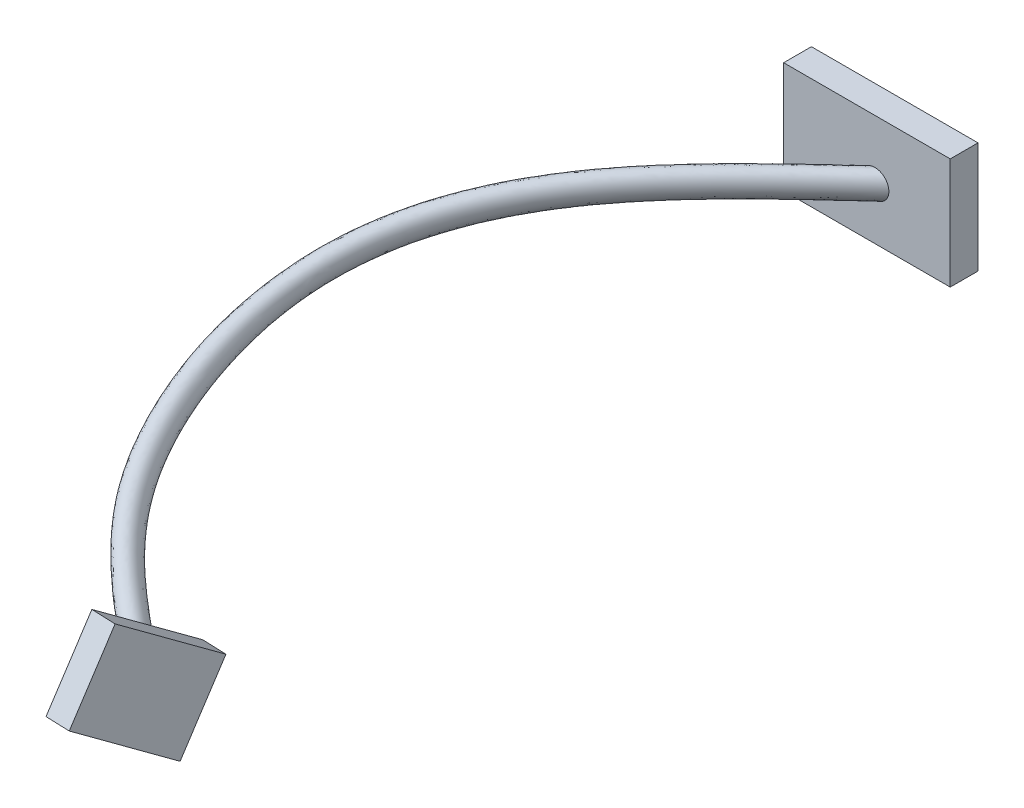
ISO-10303-21;
HEADER;
FILE_DESCRIPTION(('STEP AP214'),'2;1');
FILE_NAME('part.step','',(''),(''),'','','');
FILE_SCHEMA(('AUTOMOTIVE_DESIGN { 1 0 10303 214 1 1 1 1 }'));
ENDSEC;
DATA;
#1=APPLICATION_CONTEXT('core data for automotive mechanical design processes');
#2=APPLICATION_PROTOCOL_DEFINITION('international standard','automotive_design',2000,#1);
#3=PRODUCT_CONTEXT('',#1,'mechanical');
#4=PRODUCT('Part','Part','',(#3));
#5=PRODUCT_RELATED_PRODUCT_CATEGORY('part','',(#4));
#6=PRODUCT_DEFINITION_FORMATION('','',#4);
#7=PRODUCT_DEFINITION_CONTEXT('part definition',#1,'design');
#8=PRODUCT_DEFINITION('design','',#6,#7);
#9=PRODUCT_DEFINITION_SHAPE('','',#8);
#10=(LENGTH_UNIT() NAMED_UNIT(*) SI_UNIT(.MILLI.,.METRE.));
#11=(NAMED_UNIT(*) PLANE_ANGLE_UNIT() SI_UNIT($,.RADIAN.));
#12=(NAMED_UNIT(*) SI_UNIT($,.STERADIAN.) SOLID_ANGLE_UNIT());
#13=UNCERTAINTY_MEASURE_WITH_UNIT(LENGTH_MEASURE(1.E-05),#10,'distance_accuracy_value','');
#14=(GEOMETRIC_REPRESENTATION_CONTEXT(3) GLOBAL_UNCERTAINTY_ASSIGNED_CONTEXT((#13)) GLOBAL_UNIT_ASSIGNED_CONTEXT((#10,
#11,#12)) REPRESENTATION_CONTEXT('',''));
#15=CARTESIAN_POINT('',(0.,0.,0.));
#16=DIRECTION('',(0.,0.,1.));
#17=DIRECTION('',(1.,0.,0.));
#18=AXIS2_PLACEMENT_3D('',#15,#16,#17);
#19=CARTESIAN_POINT('',(-68.4657754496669,-154.454318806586,6.35));
#20=DIRECTION('',(-1.,0.,0.));
#21=DIRECTION('',(0.,0.,1.));
#22=AXIS2_PLACEMENT_3D('',#19,#20,#21);
#23=PLANE('',#22);
#24=DIRECTION('',(0.,1.,0.));
#25=VECTOR('',#24,1.);
#26=CARTESIAN_POINT('',(-68.4657754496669,-154.454318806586,0.));
#27=LINE('',#26,#25);
#28=CARTESIAN_POINT('',(-68.4657754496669,-154.454318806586,0.));
#29=VERTEX_POINT('',#28);
#30=CARTESIAN_POINT('',(-68.4657754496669,-129.054318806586,0.));
#31=VERTEX_POINT('',#30);
#32=EDGE_CURVE('E138',#29,#31,#27,.T.);
#33=ORIENTED_EDGE('',*,*,#32,.T.);
#34=DIRECTION('',(0.,0.,-1.));
#35=VECTOR('',#34,1.);
#36=CARTESIAN_POINT('',(-68.4657754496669,-129.054318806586,6.35));
#37=LINE('',#36,#35);
#38=CARTESIAN_POINT('',(-68.4657754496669,-129.054318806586,6.35));
#39=VERTEX_POINT('',#38);
#40=EDGE_CURVE('E35',#39,#31,#37,.T.);
#41=ORIENTED_EDGE('',*,*,#40,.F.);
#42=DIRECTION('',(0.,1.,0.));
#43=VECTOR('',#42,1.);
#44=CARTESIAN_POINT('',(-68.4657754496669,-154.454318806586,6.35));
#45=LINE('',#44,#43);
#46=CARTESIAN_POINT('',(-68.4657754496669,-154.454318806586,6.35));
#47=VERTEX_POINT('',#46);
#48=EDGE_CURVE('E147',#47,#39,#45,.T.);
#49=ORIENTED_EDGE('',*,*,#48,.F.);
#50=DIRECTION('',(0.,0.,-1.));
#51=VECTOR('',#50,1.);
#52=CARTESIAN_POINT('',(-68.4657754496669,-154.454318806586,6.35));
#53=LINE('',#52,#51);
#54=EDGE_CURVE('E154',#47,#29,#53,.T.);
#55=ORIENTED_EDGE('',*,*,#54,.T.);
#56=EDGE_LOOP('',(#33,#41,#49,#55));
#57=FACE_BOUND('',#56,.T.);
#58=ADVANCED_FACE('F28',(#57),#23,.F.);
#59=CARTESIAN_POINT('',(-68.4657754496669,-129.054318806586,6.35));
#60=DIRECTION('',(0.,-1.,0.));
#61=DIRECTION('',(0.,0.,-1.));
#62=AXIS2_PLACEMENT_3D('',#59,#60,#61);
#63=PLANE('',#62);
#64=DIRECTION('',(-1.,0.,0.));
#65=VECTOR('',#64,1.);
#66=CARTESIAN_POINT('',(-68.4657754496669,-129.054318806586,0.));
#67=LINE('',#66,#65);
#68=CARTESIAN_POINT('',(-106.565775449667,-129.054318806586,0.));
#69=VERTEX_POINT('',#68);
#70=EDGE_CURVE('E141',#31,#69,#67,.T.);
#71=ORIENTED_EDGE('',*,*,#70,.T.);
#72=DIRECTION('',(0.,0.,-1.));
#73=VECTOR('',#72,1.);
#74=CARTESIAN_POINT('',(-106.565775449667,-129.054318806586,6.35));
#75=LINE('',#74,#73);
#76=CARTESIAN_POINT('',(-106.565775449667,-129.054318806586,6.35));
#77=VERTEX_POINT('',#76);
#78=EDGE_CURVE('E160',#77,#69,#75,.T.);
#79=ORIENTED_EDGE('',*,*,#78,.F.);
#80=DIRECTION('',(-1.,0.,0.));
#81=VECTOR('',#80,1.);
#82=CARTESIAN_POINT('',(-68.4657754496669,-129.054318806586,6.35));
#83=LINE('',#82,#81);
#84=EDGE_CURVE('E149',#39,#77,#83,.T.);
#85=ORIENTED_EDGE('',*,*,#84,.F.);
#86=ORIENTED_EDGE('',*,*,#40,.T.);
#87=EDGE_LOOP('',(#71,#79,#85,#86));
#88=FACE_BOUND('',#87,.T.);
#89=ADVANCED_FACE('F165',(#88),#63,.F.);
#90=CARTESIAN_POINT('',(-106.565775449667,-154.454318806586,6.35));
#91=DIRECTION('',(1.,0.,0.));
#92=DIRECTION('',(0.,0.,-1.));
#93=AXIS2_PLACEMENT_3D('',#90,#91,#92);
#94=PLANE('',#93);
#95=DIRECTION('',(0.,-1.,0.));
#96=VECTOR('',#95,1.);
#97=CARTESIAN_POINT('',(-106.565775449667,-154.454318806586,0.));
#98=LINE('',#97,#96);
#99=CARTESIAN_POINT('',(-106.565775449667,-154.454318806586,0.));
#100=VERTEX_POINT('',#99);
#101=EDGE_CURVE('E143',#69,#100,#98,.T.);
#102=ORIENTED_EDGE('',*,*,#101,.T.);
#103=DIRECTION('',(0.,0.,-1.));
#104=VECTOR('',#103,1.);
#105=CARTESIAN_POINT('',(-106.565775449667,-154.454318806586,6.35));
#106=LINE('',#105,#104);
#107=CARTESIAN_POINT('',(-106.565775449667,-154.454318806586,6.35));
#108=VERTEX_POINT('',#107);
#109=EDGE_CURVE('E157',#108,#100,#106,.T.);
#110=ORIENTED_EDGE('',*,*,#109,.F.);
#111=DIRECTION('',(0.,-1.,0.));
#112=VECTOR('',#111,1.);
#113=CARTESIAN_POINT('',(-106.565775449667,-154.454318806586,6.35));
#114=LINE('',#113,#112);
#115=EDGE_CURVE('E151',#77,#108,#114,.T.);
#116=ORIENTED_EDGE('',*,*,#115,.F.);
#117=ORIENTED_EDGE('',*,*,#78,.T.);
#118=EDGE_LOOP('',(#102,#110,#116,#117));
#119=FACE_BOUND('',#118,.T.);
#120=ADVANCED_FACE('F176',(#119),#94,.F.);
#121=CARTESIAN_POINT('',(-68.4657754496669,-154.454318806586,6.35));
#122=DIRECTION('',(0.,1.,0.));
#123=DIRECTION('',(0.,0.,1.));
#124=AXIS2_PLACEMENT_3D('',#121,#122,#123);
#125=PLANE('',#124);
#126=DIRECTION('',(1.,0.,0.));
#127=VECTOR('',#126,1.);
#128=CARTESIAN_POINT('',(-68.4657754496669,-154.454318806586,0.));
#129=LINE('',#128,#127);
#130=EDGE_CURVE('E145',#100,#29,#129,.T.);
#131=ORIENTED_EDGE('',*,*,#130,.T.);
#132=ORIENTED_EDGE('',*,*,#54,.F.);
#133=DIRECTION('',(1.,0.,0.));
#134=VECTOR('',#133,1.);
#135=CARTESIAN_POINT('',(-68.4657754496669,-154.454318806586,6.35));
#136=LINE('',#135,#134);
#137=EDGE_CURVE('E50',#108,#47,#136,.T.);
#138=ORIENTED_EDGE('',*,*,#137,.F.);
#139=ORIENTED_EDGE('',*,*,#109,.T.);
#140=EDGE_LOOP('',(#131,#132,#138,#139));
#141=FACE_BOUND('',#140,.T.);
#142=ADVANCED_FACE('F179',(#141),#125,.F.);
#143=CARTESIAN_POINT('',(-68.4657754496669,-129.054318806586,6.35));
#144=DIRECTION('',(0.,0.,1.));
#145=DIRECTION('',(1.,0.,0.));
#146=AXIS2_PLACEMENT_3D('',#143,#144,#145);
#147=PLANE('',#146);
#148=CARTESIAN_POINT('',(-85.6754099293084,-142.53738832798,6.35));
#149=DIRECTION('',(0.,0.,1.));
#150=DIRECTION('',(1.,0.,0.));
#151=AXIS2_PLACEMENT_3D('',#148,#149,#150);
#152=CIRCLE('',#151,3.175);
#153=CARTESIAN_POINT('',(-82.5004099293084,-142.53738832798,6.35));
#154=VERTEX_POINT('',#153);
#155=EDGE_CURVE('E11',#154,#154,#152,.T.);
#156=ORIENTED_EDGE('',*,*,#155,.F.);
#157=EDGE_LOOP('',(#156));
#158=FACE_BOUND('',#157,.T.);
#159=ORIENTED_EDGE('',*,*,#48,.T.);
#160=ORIENTED_EDGE('',*,*,#84,.T.);
#161=ORIENTED_EDGE('',*,*,#115,.T.);
#162=ORIENTED_EDGE('',*,*,#137,.T.);
#163=EDGE_LOOP('',(#159,#160,#161,#162));
#164=FACE_BOUND('',#163,.T.);
#165=ADVANCED_FACE('F180',(#158,#164),#147,.T.);
#166=CARTESIAN_POINT('',(-68.4657754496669,-129.054318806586,0.));
#167=DIRECTION('',(0.,0.,1.));
#168=DIRECTION('',(1.,0.,0.));
#169=AXIS2_PLACEMENT_3D('',#166,#167,#168);
#170=PLANE('',#169);
#171=ORIENTED_EDGE('',*,*,#32,.F.);
#172=ORIENTED_EDGE('',*,*,#130,.F.);
#173=ORIENTED_EDGE('',*,*,#101,.F.);
#174=ORIENTED_EDGE('',*,*,#70,.F.);
#175=EDGE_LOOP('',(#171,#172,#173,#174));
#176=FACE_BOUND('',#175,.T.);
#177=ADVANCED_FACE('F172',(#176),#170,.F.);
#178=CARTESIAN_POINT('',(-82.5004099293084,-142.53738832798,6.35));
#179=CARTESIAN_POINT('',(-88.8441470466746,-141.555377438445,14.0126886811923));
#180=CARTESIAN_POINT('',(-101.311637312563,-139.625409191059,29.072344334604));
#181=CARTESIAN_POINT('',(-118.040149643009,-138.308978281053,52.4889000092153));
#182=CARTESIAN_POINT('',(-128.289707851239,-140.214488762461,73.7464960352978));
#183=CARTESIAN_POINT('',(-132.561764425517,-144.511595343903,91.388041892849));
#184=CARTESIAN_POINT('',(-133.74839967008,-148.741678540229,105.022174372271));
#185=CARTESIAN_POINT('',(-132.52678482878,-154.106487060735,118.283321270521));
#186=CARTESIAN_POINT('',(-128.576063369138,-159.937573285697,130.537917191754));
#187=CARTESIAN_POINT('',(-121.016978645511,-165.743775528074,140.647610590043));
#188=CARTESIAN_POINT('',(-114.043388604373,-169.301268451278,145.884991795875));
#189=CARTESIAN_POINT('',(-110.521889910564,-171.097718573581,148.529745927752));
#190=CARTESIAN_POINT('',(-82.5004099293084,-136.18738832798,6.35));
#191=CARTESIAN_POINT('',(-88.8636250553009,-135.205440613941,14.0413198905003));
#192=CARTESIAN_POINT('',(-101.369395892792,-133.27559652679,29.1572451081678));
#193=CARTESIAN_POINT('',(-118.374730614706,-131.974351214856,53.0932254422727));
#194=CARTESIAN_POINT('',(-128.96863713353,-134.057063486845,75.2340872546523));
#195=CARTESIAN_POINT('',(-133.207505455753,-138.630731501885,93.7633312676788));
#196=CARTESIAN_POINT('',(-135.502974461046,-143.29031534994,107.849032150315));
#197=CARTESIAN_POINT('',(-134.667974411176,-149.212179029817,121.751067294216));
#198=CARTESIAN_POINT('',(-130.810268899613,-155.734866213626,134.806661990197));
#199=CARTESIAN_POINT('',(-122.371128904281,-162.129196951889,145.715071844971));
#200=CARTESIAN_POINT('',(-115.275876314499,-165.711324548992,150.983350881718));
#201=CARTESIAN_POINT('',(-111.692940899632,-167.520214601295,153.643707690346));
#202=CARTESIAN_POINT('',(-88.8504099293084,-136.18738832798,6.35));
#203=CARTESIAN_POINT('',(-95.2137814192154,-135.2237380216,14.0868514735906));
#204=CARTESIAN_POINT('',(-107.71985956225,-133.329854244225,29.2922609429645));
#205=CARTESIAN_POINT('',(-124.689489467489,-132.358773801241,54.0220495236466));
#206=CARTESIAN_POINT('',(-134.926840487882,-135.131901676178,77.295307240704));
#207=CARTESIAN_POINT('',(-138.56403887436,-140.420355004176,96.765942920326));
#208=CARTESIAN_POINT('',(-140.028934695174,-146.449327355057,111.120509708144));
#209=CARTESIAN_POINT('',(-138.151919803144,-153.233283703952,125.300232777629));
#210=CARTESIAN_POINT('',(-132.916164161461,-160.543911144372,138.554913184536));
#211=CARTESIAN_POINT('',(-122.559884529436,-167.326107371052,149.43131469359));
#212=CARTESIAN_POINT('',(-115.301674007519,-170.908239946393,154.654563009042));
#213=CARTESIAN_POINT('',(-111.636448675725,-172.717132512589,157.292180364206));
#214=CARTESIAN_POINT('',(-88.8504099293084,-142.53738832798,6.35));
#215=CARTESIAN_POINT('',(-95.1943034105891,-141.573674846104,14.0582202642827));
#216=CARTESIAN_POINT('',(-107.662100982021,-139.679666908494,29.2073601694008));
#217=CARTESIAN_POINT('',(-124.354908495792,-138.693400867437,53.4177240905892));
#218=CARTESIAN_POINT('',(-134.247911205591,-141.289326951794,75.8077160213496));
#219=CARTESIAN_POINT('',(-137.918297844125,-146.301218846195,94.3906535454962));
#220=CARTESIAN_POINT('',(-138.274359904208,-151.900690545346,108.2936519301));
#221=CARTESIAN_POINT('',(-136.010730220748,-158.12759173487,121.832486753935));
#222=CARTESIAN_POINT('',(-130.681958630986,-164.746618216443,134.286168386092));
#223=CARTESIAN_POINT('',(-121.205734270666,-170.940685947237,144.363853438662));
#224=CARTESIAN_POINT('',(-114.069186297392,-174.498183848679,149.556203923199));
#225=CARTESIAN_POINT('',(-110.465397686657,-176.294636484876,152.178218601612));
#226=CARTESIAN_POINT('',(-88.8504099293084,-148.88738832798,6.35));
#227=CARTESIAN_POINT('',(-95.1748254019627,-147.923611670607,14.0295890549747));
#228=CARTESIAN_POINT('',(-107.604342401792,-146.029479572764,29.1224593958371));
#229=CARTESIAN_POINT('',(-124.020327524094,-145.028027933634,52.8133986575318));
#230=CARTESIAN_POINT('',(-133.568981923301,-147.446752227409,74.3201248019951));
#231=CARTESIAN_POINT('',(-137.272556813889,-152.182082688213,92.0153641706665));
#232=CARTESIAN_POINT('',(-136.519785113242,-157.352053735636,105.466794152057));
#233=CARTESIAN_POINT('',(-133.869540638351,-163.021899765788,118.36474073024));
#234=CARTESIAN_POINT('',(-128.447753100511,-168.949325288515,130.017423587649));
#235=CARTESIAN_POINT('',(-119.851584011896,-174.555264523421,139.296392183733));
#236=CARTESIAN_POINT('',(-112.836698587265,-178.088127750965,144.457844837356));
#237=CARTESIAN_POINT('',(-109.294346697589,-179.872140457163,147.064256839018));
#238=CARTESIAN_POINT('',(-82.5004099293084,-148.88738832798,6.35));
#239=CARTESIAN_POINT('',(-88.8246690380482,-147.905314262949,13.9840574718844));
#240=CARTESIAN_POINT('',(-101.253878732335,-145.975221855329,28.9874435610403));
#241=CARTESIAN_POINT('',(-117.705568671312,-144.643605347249,51.8845745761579));
#242=CARTESIAN_POINT('',(-127.610778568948,-146.371914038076,72.2589048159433));
#243=CARTESIAN_POINT('',(-131.916023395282,-150.392459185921,89.0127525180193));
#244=CARTESIAN_POINT('',(-131.993824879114,-154.193041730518,102.195316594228));
#245=CARTESIAN_POINT('',(-130.385595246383,-159.000795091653,114.815575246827));
#246=CARTESIAN_POINT('',(-126.341857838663,-164.140280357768,126.26917239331));
#247=CARTESIAN_POINT('',(-119.66282838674,-169.358354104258,135.580149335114));
#248=CARTESIAN_POINT('',(-112.810900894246,-172.891212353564,140.786632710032));
#249=CARTESIAN_POINT('',(-109.350838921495,-174.675222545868,143.415784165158));
#250=CARTESIAN_POINT('',(-82.5004099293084,-142.53738832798,6.35));
#251=CARTESIAN_POINT('',(-88.8441470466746,-141.555377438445,14.0126886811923));
#252=CARTESIAN_POINT('',(-101.311637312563,-139.625409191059,29.072344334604));
#253=CARTESIAN_POINT('',(-118.040149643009,-138.308978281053,52.4889000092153));
#254=CARTESIAN_POINT('',(-128.289707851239,-140.214488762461,73.7464960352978));
#255=CARTESIAN_POINT('',(-132.561764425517,-144.511595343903,91.388041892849));
#256=CARTESIAN_POINT('',(-133.74839967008,-148.741678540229,105.022174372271));
#257=CARTESIAN_POINT('',(-132.52678482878,-154.106487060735,118.283321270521));
#258=CARTESIAN_POINT('',(-128.576063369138,-159.937573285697,130.537917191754));
#259=CARTESIAN_POINT('',(-121.016978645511,-165.743775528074,140.647610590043));
#260=CARTESIAN_POINT('',(-114.043388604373,-169.301268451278,145.884991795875));
#261=CARTESIAN_POINT('',(-110.521889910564,-171.097718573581,148.529745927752));
#262=(BOUNDED_SURFACE() B_SPLINE_SURFACE(3,3,((#178,#179,#180,#181,#182,#183,#184,#185,#186,
#187,#188,#189),(#190,#191,#192,#193,#194,#195,#196,#197,#198,#199,#200,#201),(#202,#203,#204,
#205,#206,#207,#208,#209,#210,#211,#212,#213),(#214,#215,#216,#217,#218,#219,#220,#221,#222,
#223,#224,#225),(#226,#227,#228,#229,#230,#231,#232,#233,#234,#235,#236,#237),(#238,#239,#240,
#241,#242,#243,#244,#245,#246,#247,#248,#249),(#250,#251,#252,#253,#254,#255,#256,#257,#258,
#259,#260,#261)),.UNSPECIFIED.,.T.,.F.,.F.) B_SPLINE_SURFACE_WITH_KNOTS((4,3,4),(4,1,1,1,1,1,1,
1,1,4),(0.,0.5,1.),(0.,0.173299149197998,0.340588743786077,0.501817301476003,0.583812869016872,
0.668703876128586,0.753679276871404,0.836441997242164,0.917407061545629,1.),
.UNSPECIFIED.) GEOMETRIC_REPRESENTATION_ITEM() RATIONAL_B_SPLINE_SURFACE(((1.,1.,1.,1.,1.,1.,1.,
1.,1.,1.,1.,1.),(0.333333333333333,0.333333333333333,0.333333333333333,0.333333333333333,
0.333333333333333,0.333333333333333,0.333333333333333,0.333333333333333,0.333333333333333,
0.333333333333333,0.333333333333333,0.333333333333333),(0.333333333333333,0.333333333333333,
0.333333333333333,0.333333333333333,0.333333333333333,0.333333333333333,0.333333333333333,
0.333333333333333,0.333333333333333,0.333333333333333,0.333333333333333,0.333333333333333),(1.,
1.,1.,1.,1.,1.,1.,1.,1.,1.,1.,1.),(0.333333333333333,0.333333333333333,0.333333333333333,
0.333333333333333,0.333333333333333,0.333333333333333,0.333333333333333,0.333333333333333,
0.333333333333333,0.333333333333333,0.333333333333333,0.333333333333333),(0.333333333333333,
0.333333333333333,0.333333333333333,0.333333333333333,0.333333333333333,0.333333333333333,
0.333333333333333,0.333333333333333,0.333333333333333,0.333333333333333,0.333333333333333,
0.333333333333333),(1.,1.,1.,1.,1.,1.,1.,1.,1.,1.,1.,1.))) REPRESENTATION_ITEM('') SURFACE());
#263=CARTESIAN_POINT('',(-110.49364379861,-173.696177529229,150.353982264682));
#264=DIRECTION('',(-0.982807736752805,-0.113124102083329,-0.145917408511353));
#265=DIRECTION('',(-0.146860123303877,0.,0.989157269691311));
#266=AXIS2_PLACEMENT_3D('',#263,#264,#265);
#267=CIRCLE('',#266,3.17500000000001);
#268=CARTESIAN_POINT('',(-110.530717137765,-171.071037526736,148.568515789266));
#269=VERTEX_POINT('',#268);
#270=EDGE_CURVE('E101',#269,#269,#267,.T.);
#271=ORIENTED_EDGE('',*,*,#155,.T.);
#272=EDGE_LOOP('',(#271));
#273=FACE_BOUND('',#272,.T.);
#274=ORIENTED_EDGE('',*,*,#270,.T.);
#275=EDGE_LOOP('',(#274));
#276=FACE_BOUND('',#275,.T.);
#277=ADVANCED_FACE('F188',(#273,#276),#262,.T.);
#278=CARTESIAN_POINT('',(-101.832050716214,-177.702104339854,138.638356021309));
#279=DIRECTION('',(-0.1842623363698,0.550979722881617,0.813921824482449));
#280=DIRECTION('',(0.,-0.828101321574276,0.560578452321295));
#281=AXIS2_PLACEMENT_3D('',#278,#279,#280);
#282=PLANE('',#281);
#283=DIRECTION('',(-0.0116766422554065,0.826815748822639,-0.562351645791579));
#284=VECTOR('',#283,1.);
#285=CARTESIAN_POINT('',(-108.072879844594,-178.420442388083,137.711780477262));
#286=LINE('',#285,#284);
#287=CARTESIAN_POINT('',(-107.850439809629,-194.171282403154,148.424579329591));
#288=VERTEX_POINT('',#287);
#289=CARTESIAN_POINT('',(-108.072879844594,-178.420442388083,137.711780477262));
#290=VERTEX_POINT('',#289);
#291=EDGE_CURVE('E99',#288,#290,#286,.T.);
#292=ORIENTED_EDGE('',*,*,#291,.T.);
#293=DIRECTION('',(-0.982807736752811,-0.113124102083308,-0.145917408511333));
#294=VECTOR('',#293,1.);
#295=CARTESIAN_POINT('',(-101.832050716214,-177.702104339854,138.638356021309));
#296=LINE('',#295,#294);
#297=CARTESIAN_POINT('',(-101.832050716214,-177.702104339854,138.638356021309));
#298=VERTEX_POINT('',#297);
#299=EDGE_CURVE('E106',#298,#290,#296,.T.);
#300=ORIENTED_EDGE('',*,*,#299,.F.);
#301=DIRECTION('',(-0.0116766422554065,0.826815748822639,-0.562351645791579));
#302=VECTOR('',#301,1.);
#303=CARTESIAN_POINT('',(-101.832050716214,-177.702104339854,138.638356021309));
#304=LINE('',#303,#302);
#305=CARTESIAN_POINT('',(-101.609610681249,-193.452944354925,149.351154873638));
#306=VERTEX_POINT('',#305);
#307=EDGE_CURVE('E124',#306,#298,#304,.T.);
#308=ORIENTED_EDGE('',*,*,#307,.F.);
#309=DIRECTION('',(-0.982807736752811,-0.113124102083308,-0.145917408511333));
#310=VECTOR('',#309,1.);
#311=CARTESIAN_POINT('',(-101.609610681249,-193.452944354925,149.351154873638));
#312=LINE('',#311,#310);
#313=EDGE_CURVE('E118',#306,#288,#312,.T.);
#314=ORIENTED_EDGE('',*,*,#313,.T.);
#315=EDGE_LOOP('',(#292,#300,#308,#314));
#316=FACE_BOUND('',#315,.T.);
#317=ADVANCED_FACE('F116',(#316),#282,.F.);
#318=CARTESIAN_POINT('',(-101.832050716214,-177.702104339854,138.638356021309));
#319=DIRECTION('',(0.0116766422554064,-0.826815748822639,0.56235164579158));
#320=DIRECTION('',(0.,-0.562389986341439,-0.826872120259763));
#321=AXIS2_PLACEMENT_3D('',#318,#319,#320);
#322=PLANE('',#321);
#323=DIRECTION('',(-0.1842623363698,0.550979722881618,0.813921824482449));
#324=VECTOR('',#323,1.);
#325=CARTESIAN_POINT('',(-108.072879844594,-178.420442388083,137.711780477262));
#326=LINE('',#325,#324);
#327=EDGE_CURVE('E42',#290,#269,#326,.T.);
#328=ORIENTED_EDGE('',*,*,#327,.T.);
#329=CARTESIAN_POINT('',(-112.753143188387,-164.42555742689,158.385394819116));
#330=VERTEX_POINT('',#329);
#331=EDGE_CURVE('E103',#269,#330,#326,.T.);
#332=ORIENTED_EDGE('',*,*,#331,.T.);
#333=DIRECTION('',(-0.982807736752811,-0.113124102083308,-0.145917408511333));
#334=VECTOR('',#333,1.);
#335=CARTESIAN_POINT('',(-106.512314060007,-163.707219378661,159.311970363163));
#336=LINE('',#335,#334);
#337=CARTESIAN_POINT('',(-106.512314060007,-163.707219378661,159.311970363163));
#338=VERTEX_POINT('',#337);
#339=EDGE_CURVE('E113',#338,#330,#336,.T.);
#340=ORIENTED_EDGE('',*,*,#339,.F.);
#341=DIRECTION('',(-0.1842623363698,0.550979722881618,0.813921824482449));
#342=VECTOR('',#341,1.);
#343=CARTESIAN_POINT('',(-101.832050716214,-177.702104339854,138.638356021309));
#344=LINE('',#343,#342);
#345=EDGE_CURVE('E109',#298,#338,#344,.T.);
#346=ORIENTED_EDGE('',*,*,#345,.F.);
#347=ORIENTED_EDGE('',*,*,#299,.T.);
#348=EDGE_LOOP('',(#328,#332,#340,#346,#347));
#349=FACE_BOUND('',#348,.T.);
#350=ADVANCED_FACE('F107',(#349),#322,.F.);
#351=CARTESIAN_POINT('',(-106.512314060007,-163.707219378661,159.311970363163));
#352=DIRECTION('',(0.1842623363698,-0.550979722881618,-0.813921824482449));
#353=DIRECTION('',(0.,0.828101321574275,-0.560578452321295));
#354=AXIS2_PLACEMENT_3D('',#351,#352,#353);
#355=PLANE('',#354);
#356=DIRECTION('',(0.0116766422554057,-0.826815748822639,0.56235164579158));
#357=VECTOR('',#356,1.);
#358=CARTESIAN_POINT('',(-112.753143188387,-164.42555742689,158.385394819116));
#359=LINE('',#358,#357);
#360=CARTESIAN_POINT('',(-112.530703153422,-180.176397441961,169.098193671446));
#361=VERTEX_POINT('',#360);
#362=EDGE_CURVE('E102',#330,#361,#359,.T.);
#363=ORIENTED_EDGE('',*,*,#362,.T.);
#364=DIRECTION('',(-0.982807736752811,-0.113124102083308,-0.145917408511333));
#365=VECTOR('',#364,1.);
#366=CARTESIAN_POINT('',(-106.289874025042,-179.458059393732,170.024769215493));
#367=LINE('',#366,#365);
#368=CARTESIAN_POINT('',(-106.289874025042,-179.458059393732,170.024769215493));
#369=VERTEX_POINT('',#368);
#370=EDGE_CURVE('E132',#369,#361,#367,.T.);
#371=ORIENTED_EDGE('',*,*,#370,.F.);
#372=DIRECTION('',(0.0116766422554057,-0.826815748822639,0.56235164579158));
#373=VECTOR('',#372,1.);
#374=CARTESIAN_POINT('',(-106.512314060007,-163.707219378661,159.311970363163));
#375=LINE('',#374,#373);
#376=EDGE_CURVE('E127',#338,#369,#375,.T.);
#377=ORIENTED_EDGE('',*,*,#376,.F.);
#378=ORIENTED_EDGE('',*,*,#339,.T.);
#379=EDGE_LOOP('',(#363,#371,#377,#378));
#380=FACE_BOUND('',#379,.T.);
#381=ADVANCED_FACE('F232',(#380),#355,.F.);
#382=CARTESIAN_POINT('',(-101.609610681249,-193.452944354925,149.351154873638));
#383=DIRECTION('',(-0.0116766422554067,0.82681574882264,-0.562351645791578));
#384=DIRECTION('',(0.,0.562389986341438,0.826872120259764));
#385=AXIS2_PLACEMENT_3D('',#382,#383,#384);
#386=PLANE('',#385);
#387=DIRECTION('',(0.1842623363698,-0.550979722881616,-0.81392182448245));
#388=VECTOR('',#387,1.);
#389=CARTESIAN_POINT('',(-107.850439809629,-194.171282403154,148.424579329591));
#390=LINE('',#389,#388);
#391=EDGE_CURVE('E122',#361,#288,#390,.T.);
#392=ORIENTED_EDGE('',*,*,#391,.T.);
#393=ORIENTED_EDGE('',*,*,#313,.F.);
#394=DIRECTION('',(0.1842623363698,-0.550979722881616,-0.81392182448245));
#395=VECTOR('',#394,1.);
#396=CARTESIAN_POINT('',(-101.609610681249,-193.452944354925,149.351154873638));
#397=LINE('',#396,#395);
#398=EDGE_CURVE('E129',#369,#306,#397,.T.);
#399=ORIENTED_EDGE('',*,*,#398,.F.);
#400=ORIENTED_EDGE('',*,*,#370,.T.);
#401=EDGE_LOOP('',(#392,#393,#399,#400));
#402=FACE_BOUND('',#401,.T.);
#403=ADVANCED_FACE('F239',(#402),#386,.F.);
#404=CARTESIAN_POINT('',(-101.832050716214,-177.702104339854,138.638356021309));
#405=DIRECTION('',(-0.982807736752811,-0.113124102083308,-0.145917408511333));
#406=DIRECTION('',(-0.146860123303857,0.,0.989157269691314));
#407=AXIS2_PLACEMENT_3D('',#404,#405,#406);
#408=PLANE('',#407);
#409=ORIENTED_EDGE('',*,*,#307,.T.);
#410=ORIENTED_EDGE('',*,*,#345,.T.);
#411=ORIENTED_EDGE('',*,*,#376,.T.);
#412=ORIENTED_EDGE('',*,*,#398,.T.);
#413=EDGE_LOOP('',(#409,#410,#411,#412));
#414=FACE_BOUND('',#413,.T.);
#415=ADVANCED_FACE('F247',(#414),#408,.F.);
#416=CARTESIAN_POINT('',(-108.072879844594,-178.420442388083,137.711780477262));
#417=DIRECTION('',(-0.982807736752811,-0.113124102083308,-0.145917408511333));
#418=DIRECTION('',(-0.146860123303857,0.,0.989157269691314));
#419=AXIS2_PLACEMENT_3D('',#416,#417,#418);
#420=PLANE('',#419);
#421=ORIENTED_EDGE('',*,*,#331,.F.);
#422=ORIENTED_EDGE('',*,*,#270,.F.);
#423=ORIENTED_EDGE('',*,*,#327,.F.);
#424=ORIENTED_EDGE('',*,*,#291,.F.);
#425=ORIENTED_EDGE('',*,*,#391,.F.);
#426=ORIENTED_EDGE('',*,*,#362,.F.);
#427=EDGE_LOOP('',(#421,#422,#423,#424,#425,#426));
#428=FACE_BOUND('',#427,.T.);
#429=ADVANCED_FACE('F96',(#428),#420,.T.);
#430=CLOSED_SHELL('',(#58,#89,#120,#142,#165,#177,#277,#317,#350,#381,#403,#415,#429));
#431=MANIFOLD_SOLID_BREP('B2',#430);
#432=ADVANCED_BREP_SHAPE_REPRESENTATION('',(#18,#431),#14);
#433=SHAPE_DEFINITION_REPRESENTATION(#9,#432);
ENDSEC;
END-ISO-10303-21;
